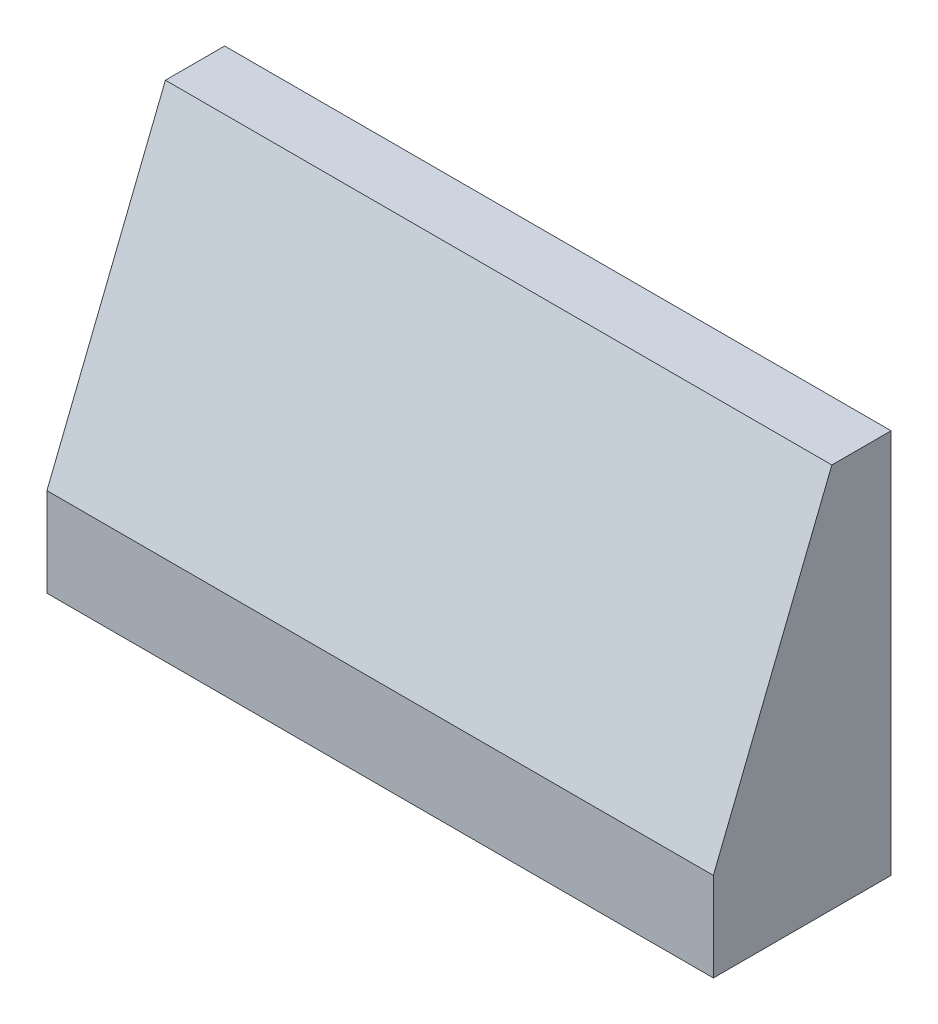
ISO-10303-21;
HEADER;
FILE_DESCRIPTION(('STEP AP214'),'2;1');
FILE_NAME('part.step','',(''),(''),'','','');
FILE_SCHEMA(('AUTOMOTIVE_DESIGN { 1 0 10303 214 1 1 1 1 }'));
ENDSEC;
DATA;
#1=APPLICATION_CONTEXT('core data for automotive mechanical design processes');
#2=APPLICATION_PROTOCOL_DEFINITION('international standard','automotive_design',2000,#1);
#3=PRODUCT_CONTEXT('',#1,'mechanical');
#4=PRODUCT('Part','Part','',(#3));
#5=PRODUCT_RELATED_PRODUCT_CATEGORY('part','',(#4));
#6=PRODUCT_DEFINITION_FORMATION('','',#4);
#7=PRODUCT_DEFINITION_CONTEXT('part definition',#1,'design');
#8=PRODUCT_DEFINITION('design','',#6,#7);
#9=PRODUCT_DEFINITION_SHAPE('','',#8);
#10=(LENGTH_UNIT() NAMED_UNIT(*) SI_UNIT(.MILLI.,.METRE.));
#11=(NAMED_UNIT(*) PLANE_ANGLE_UNIT() SI_UNIT($,.RADIAN.));
#12=(NAMED_UNIT(*) SI_UNIT($,.STERADIAN.) SOLID_ANGLE_UNIT());
#13=UNCERTAINTY_MEASURE_WITH_UNIT(LENGTH_MEASURE(1.E-05),#10,'distance_accuracy_value','');
#14=(GEOMETRIC_REPRESENTATION_CONTEXT(3) GLOBAL_UNCERTAINTY_ASSIGNED_CONTEXT((#13)) GLOBAL_UNIT_ASSIGNED_CONTEXT((#10,
#11,#12)) REPRESENTATION_CONTEXT('',''));
#15=CARTESIAN_POINT('',(0.,0.,0.));
#16=DIRECTION('',(0.,0.,1.));
#17=DIRECTION('',(1.,0.,0.));
#18=AXIS2_PLACEMENT_3D('',#15,#16,#17);
#19=CARTESIAN_POINT('',(-45.,0.,0.));
#20=DIRECTION('',(0.,0.,1.));
#21=DIRECTION('',(1.,0.,0.));
#22=AXIS2_PLACEMENT_3D('',#19,#20,#21);
#23=PLANE('',#22);
#24=DIRECTION('',(0.,-1.,0.));
#25=VECTOR('',#24,1.);
#26=CARTESIAN_POINT('',(0.,0.,0.));
#27=LINE('',#26,#25);
#28=CARTESIAN_POINT('',(0.,6.,0.));
#29=VERTEX_POINT('',#28);
#30=CARTESIAN_POINT('',(0.,0.,0.));
#31=VERTEX_POINT('',#30);
#32=EDGE_CURVE('E108',#29,#31,#27,.T.);
#33=ORIENTED_EDGE('',*,*,#32,.F.);
#34=DIRECTION('',(1.,0.,0.));
#35=VECTOR('',#34,1.);
#36=CARTESIAN_POINT('',(-45.,6.,0.));
#37=LINE('',#36,#35);
#38=CARTESIAN_POINT('',(-45.,6.,0.));
#39=VERTEX_POINT('',#38);
#40=EDGE_CURVE('E11',#39,#29,#37,.T.);
#41=ORIENTED_EDGE('',*,*,#40,.F.);
#42=DIRECTION('',(0.,-1.,0.));
#43=VECTOR('',#42,1.);
#44=CARTESIAN_POINT('',(-45.,0.,0.));
#45=LINE('',#44,#43);
#46=CARTESIAN_POINT('',(-45.,0.,0.));
#47=VERTEX_POINT('',#46);
#48=EDGE_CURVE('E120',#39,#47,#45,.T.);
#49=ORIENTED_EDGE('',*,*,#48,.T.);
#50=DIRECTION('',(1.,0.,0.));
#51=VECTOR('',#50,1.);
#52=CARTESIAN_POINT('',(-45.,0.,0.));
#53=LINE('',#52,#51);
#54=EDGE_CURVE('E36',#47,#31,#53,.T.);
#55=ORIENTED_EDGE('',*,*,#54,.T.);
#56=EDGE_LOOP('',(#33,#41,#49,#55));
#57=FACE_BOUND('',#56,.T.);
#58=ADVANCED_FACE('F33',(#57),#23,.T.);
#59=CARTESIAN_POINT('',(-45.,26.,-8.));
#60=DIRECTION('',(0.,0.371390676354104,0.928476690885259));
#61=DIRECTION('',(0.,-0.92847669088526,0.371390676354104));
#62=AXIS2_PLACEMENT_3D('',#59,#60,#61);
#63=PLANE('',#62);
#64=DIRECTION('',(0.,-0.928476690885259,0.371390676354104));
#65=VECTOR('',#64,1.);
#66=CARTESIAN_POINT('',(0.,26.,-8.));
#67=LINE('',#66,#65);
#68=CARTESIAN_POINT('',(0.,26.,-8.));
#69=VERTEX_POINT('',#68);
#70=EDGE_CURVE('E118',#69,#29,#67,.T.);
#71=ORIENTED_EDGE('',*,*,#70,.F.);
#72=DIRECTION('',(1.,0.,0.));
#73=VECTOR('',#72,1.);
#74=CARTESIAN_POINT('',(-45.,26.,-8.));
#75=LINE('',#74,#73);
#76=CARTESIAN_POINT('',(-45.,26.,-8.));
#77=VERTEX_POINT('',#76);
#78=EDGE_CURVE('E42',#77,#69,#75,.T.);
#79=ORIENTED_EDGE('',*,*,#78,.F.);
#80=DIRECTION('',(0.,-0.928476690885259,0.371390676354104));
#81=VECTOR('',#80,1.);
#82=CARTESIAN_POINT('',(-45.,26.,-8.));
#83=LINE('',#82,#81);
#84=EDGE_CURVE('E103',#77,#39,#83,.T.);
#85=ORIENTED_EDGE('',*,*,#84,.T.);
#86=ORIENTED_EDGE('',*,*,#40,.T.);
#87=EDGE_LOOP('',(#71,#79,#85,#86));
#88=FACE_BOUND('',#87,.T.);
#89=ADVANCED_FACE('F125',(#88),#63,.T.);
#90=CARTESIAN_POINT('',(-45.,26.,-12.));
#91=DIRECTION('',(0.,1.,0.));
#92=DIRECTION('',(0.,0.,1.));
#93=AXIS2_PLACEMENT_3D('',#90,#91,#92);
#94=PLANE('',#93);
#95=DIRECTION('',(0.,0.,1.));
#96=VECTOR('',#95,1.);
#97=CARTESIAN_POINT('',(0.,26.,-12.));
#98=LINE('',#97,#96);
#99=CARTESIAN_POINT('',(0.,26.,-12.));
#100=VERTEX_POINT('',#99);
#101=EDGE_CURVE('E99',#100,#69,#98,.T.);
#102=ORIENTED_EDGE('',*,*,#101,.F.);
#103=DIRECTION('',(1.,0.,0.));
#104=VECTOR('',#103,1.);
#105=CARTESIAN_POINT('',(-45.,26.,-12.));
#106=LINE('',#105,#104);
#107=CARTESIAN_POINT('',(-45.,26.,-12.));
#108=VERTEX_POINT('',#107);
#109=EDGE_CURVE('E89',#108,#100,#106,.T.);
#110=ORIENTED_EDGE('',*,*,#109,.F.);
#111=DIRECTION('',(0.,0.,1.));
#112=VECTOR('',#111,1.);
#113=CARTESIAN_POINT('',(-45.,26.,-12.));
#114=LINE('',#113,#112);
#115=EDGE_CURVE('E94',#108,#77,#114,.T.);
#116=ORIENTED_EDGE('',*,*,#115,.T.);
#117=ORIENTED_EDGE('',*,*,#78,.T.);
#118=EDGE_LOOP('',(#102,#110,#116,#117));
#119=FACE_BOUND('',#118,.T.);
#120=ADVANCED_FACE('F97',(#119),#94,.T.);
#121=CARTESIAN_POINT('',(-45.,6.,-12.));
#122=DIRECTION('',(0.,0.,-1.));
#123=DIRECTION('',(-1.,0.,0.));
#124=AXIS2_PLACEMENT_3D('',#121,#122,#123);
#125=PLANE('',#124);
#126=DIRECTION('',(0.,1.,0.));
#127=VECTOR('',#126,1.);
#128=CARTESIAN_POINT('',(0.,6.,-12.));
#129=LINE('',#128,#127);
#130=CARTESIAN_POINT('',(0.,0.,-12.));
#131=VERTEX_POINT('',#130);
#132=EDGE_CURVE('E115',#131,#100,#129,.T.);
#133=ORIENTED_EDGE('',*,*,#132,.F.);
#134=DIRECTION('',(1.,0.,0.));
#135=VECTOR('',#134,1.);
#136=CARTESIAN_POINT('',(-45.,0.,-12.));
#137=LINE('',#136,#135);
#138=CARTESIAN_POINT('',(-45.,0.,-12.));
#139=VERTEX_POINT('',#138);
#140=EDGE_CURVE('E91',#139,#131,#137,.T.);
#141=ORIENTED_EDGE('',*,*,#140,.F.);
#142=DIRECTION('',(0.,1.,0.));
#143=VECTOR('',#142,1.);
#144=CARTESIAN_POINT('',(-45.,0.,-12.));
#145=LINE('',#144,#143);
#146=EDGE_CURVE('E86',#139,#108,#145,.T.);
#147=ORIENTED_EDGE('',*,*,#146,.T.);
#148=ORIENTED_EDGE('',*,*,#109,.T.);
#149=EDGE_LOOP('',(#133,#141,#147,#148));
#150=FACE_BOUND('',#149,.T.);
#151=ADVANCED_FACE('F88',(#150),#125,.T.);
#152=CARTESIAN_POINT('',(-45.,0.,0.));
#153=DIRECTION('',(0.,-1.,0.));
#154=DIRECTION('',(0.,0.,-1.));
#155=AXIS2_PLACEMENT_3D('',#152,#153,#154);
#156=PLANE('',#155);
#157=CARTESIAN_POINT('',(-33.75,0.,-6.));
#158=DIRECTION('',(0.,-1.,0.));
#159=DIRECTION('',(0.,0.,-1.));
#160=AXIS2_PLACEMENT_3D('',#157,#158,#159);
#161=CIRCLE('',#160,3.99999999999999);
#162=CARTESIAN_POINT('',(-33.75,0.,-9.99999999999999));
#163=VERTEX_POINT('',#162);
#164=EDGE_CURVE('E147',#163,#163,#161,.T.);
#165=ORIENTED_EDGE('',*,*,#164,.F.);
#166=EDGE_LOOP('',(#165));
#167=FACE_BOUND('',#166,.T.);
#168=CARTESIAN_POINT('',(-11.25,0.,-6.));
#169=DIRECTION('',(0.,-1.,0.));
#170=DIRECTION('',(0.,0.,-1.));
#171=AXIS2_PLACEMENT_3D('',#168,#169,#170);
#172=CIRCLE('',#171,4.);
#173=CARTESIAN_POINT('',(-11.25,0.,-10.));
#174=VERTEX_POINT('',#173);
#175=EDGE_CURVE('E150',#174,#174,#172,.T.);
#176=ORIENTED_EDGE('',*,*,#175,.F.);
#177=EDGE_LOOP('',(#176));
#178=FACE_BOUND('',#177,.T.);
#179=DIRECTION('',(0.,0.,-1.));
#180=VECTOR('',#179,1.);
#181=CARTESIAN_POINT('',(0.,0.,0.));
#182=LINE('',#181,#180);
#183=EDGE_CURVE('E111',#31,#131,#182,.T.);
#184=ORIENTED_EDGE('',*,*,#183,.F.);
#185=ORIENTED_EDGE('',*,*,#54,.F.);
#186=DIRECTION('',(0.,0.,-1.));
#187=VECTOR('',#186,1.);
#188=CARTESIAN_POINT('',(-45.,0.,0.));
#189=LINE('',#188,#187);
#190=EDGE_CURVE('E95',#47,#139,#189,.T.);
#191=ORIENTED_EDGE('',*,*,#190,.T.);
#192=ORIENTED_EDGE('',*,*,#140,.T.);
#193=EDGE_LOOP('',(#184,#185,#191,#192));
#194=FACE_BOUND('',#193,.T.);
#195=ADVANCED_FACE('F122',(#167,#178,#194),#156,.T.);
#196=CARTESIAN_POINT('',(-45.,0.,0.));
#197=DIRECTION('',(1.,0.,0.));
#198=DIRECTION('',(0.,0.,-1.));
#199=AXIS2_PLACEMENT_3D('',#196,#197,#198);
#200=PLANE('',#199);
#201=ORIENTED_EDGE('',*,*,#48,.F.);
#202=ORIENTED_EDGE('',*,*,#84,.F.);
#203=ORIENTED_EDGE('',*,*,#115,.F.);
#204=ORIENTED_EDGE('',*,*,#146,.F.);
#205=ORIENTED_EDGE('',*,*,#190,.F.);
#206=EDGE_LOOP('',(#201,#202,#203,#204,#205));
#207=FACE_BOUND('',#206,.T.);
#208=ADVANCED_FACE('F102',(#207),#200,.F.);
#209=CARTESIAN_POINT('',(0.,0.,0.));
#210=DIRECTION('',(1.,0.,0.));
#211=DIRECTION('',(0.,0.,-1.));
#212=AXIS2_PLACEMENT_3D('',#209,#210,#211);
#213=PLANE('',#212);
#214=ORIENTED_EDGE('',*,*,#32,.T.);
#215=ORIENTED_EDGE('',*,*,#183,.T.);
#216=ORIENTED_EDGE('',*,*,#132,.T.);
#217=ORIENTED_EDGE('',*,*,#101,.T.);
#218=ORIENTED_EDGE('',*,*,#70,.T.);
#219=EDGE_LOOP('',(#214,#215,#216,#217,#218));
#220=FACE_BOUND('',#219,.T.);
#221=ADVANCED_FACE('F124',(#220),#213,.T.);
#222=CARTESIAN_POINT('',(-11.25,5.,-6.));
#223=DIRECTION('',(0.,-1.,0.));
#224=DIRECTION('',(0.,0.,-1.));
#225=AXIS2_PLACEMENT_3D('',#222,#223,#224);
#226=CYLINDRICAL_SURFACE('',#225,4.);
#227=CARTESIAN_POINT('',(-11.25,5.,-6.));
#228=DIRECTION('',(0.,-1.,0.));
#229=DIRECTION('',(0.,0.,-1.));
#230=AXIS2_PLACEMENT_3D('',#227,#228,#229);
#231=CIRCLE('',#230,4.);
#232=CARTESIAN_POINT('',(-11.25,5.,-10.));
#233=VERTEX_POINT('',#232);
#234=EDGE_CURVE('E152',#233,#233,#231,.T.);
#235=ORIENTED_EDGE('',*,*,#234,.F.);
#236=EDGE_LOOP('',(#235));
#237=FACE_BOUND('',#236,.T.);
#238=ORIENTED_EDGE('',*,*,#175,.T.);
#239=EDGE_LOOP('',(#238));
#240=FACE_BOUND('',#239,.T.);
#241=ADVANCED_FACE('F174',(#237,#240),#226,.F.);
#242=CARTESIAN_POINT('',(-11.25,5.,-6.));
#243=DIRECTION('',(0.,-1.,0.));
#244=DIRECTION('',(0.,0.,-1.));
#245=AXIS2_PLACEMENT_3D('',#242,#243,#244);
#246=PLANE('',#245);
#247=ORIENTED_EDGE('',*,*,#234,.T.);
#248=EDGE_LOOP('',(#247));
#249=FACE_BOUND('',#248,.T.);
#250=ADVANCED_FACE('F167',(#249),#246,.T.);
#251=CARTESIAN_POINT('',(-33.75,5.,-6.));
#252=DIRECTION('',(0.,-1.,0.));
#253=DIRECTION('',(0.,0.,-1.));
#254=AXIS2_PLACEMENT_3D('',#251,#252,#253);
#255=CYLINDRICAL_SURFACE('',#254,3.99999999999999);
#256=CARTESIAN_POINT('',(-33.75,5.,-6.));
#257=DIRECTION('',(0.,-1.,0.));
#258=DIRECTION('',(0.,0.,-1.));
#259=AXIS2_PLACEMENT_3D('',#256,#257,#258);
#260=CIRCLE('',#259,3.99999999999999);
#261=CARTESIAN_POINT('',(-33.75,5.,-9.99999999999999));
#262=VERTEX_POINT('',#261);
#263=EDGE_CURVE('E112',#262,#262,#260,.T.);
#264=ORIENTED_EDGE('',*,*,#263,.F.);
#265=EDGE_LOOP('',(#264));
#266=FACE_BOUND('',#265,.T.);
#267=ORIENTED_EDGE('',*,*,#164,.T.);
#268=EDGE_LOOP('',(#267));
#269=FACE_BOUND('',#268,.T.);
#270=ADVANCED_FACE('F164',(#266,#269),#255,.F.);
#271=CARTESIAN_POINT('',(-33.75,5.,-6.));
#272=DIRECTION('',(0.,-1.,0.));
#273=DIRECTION('',(0.,0.,-1.));
#274=AXIS2_PLACEMENT_3D('',#271,#272,#273);
#275=PLANE('',#274);
#276=ORIENTED_EDGE('',*,*,#263,.T.);
#277=EDGE_LOOP('',(#276));
#278=FACE_BOUND('',#277,.T.);
#279=ADVANCED_FACE('F162',(#278),#275,.T.);
#280=CLOSED_SHELL('',(#58,#89,#120,#151,#195,#208,#221,#241,#250,#270,#279));
#281=MANIFOLD_SOLID_BREP('B2',#280);
#282=ADVANCED_BREP_SHAPE_REPRESENTATION('',(#18,#281),#14);
#283=SHAPE_DEFINITION_REPRESENTATION(#9,#282);
ENDSEC;
END-ISO-10303-21;
